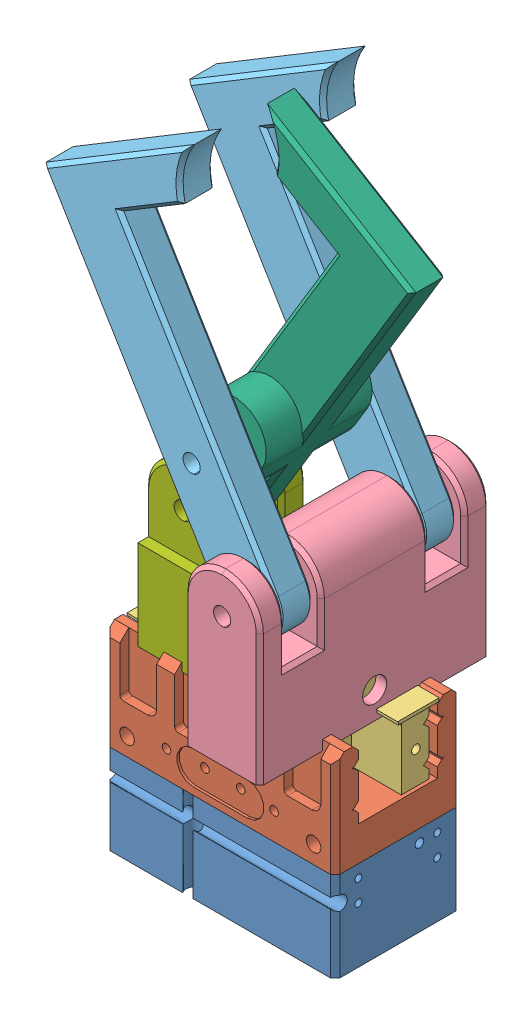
SolidWorks assembly scissor_draft3_assembly.SLDASM, configuration Default (file format 15000). Lengths in mm.
Overall size (107.7 189.3 64).
9 component instances, 7 part files, 23 mates.
Components (placement in the parent):
- SCHUNK-5518814 Gehaeuse MPG-plus 64-1: SCHUNK-5518814 Gehaeuse MPG-plus 64.sldprt [Default] at (0 25 0) x (1 0 0) z (0 0 -1) size (64.01 25 35.01)
- SCHUNK-5518813 Abdeckgehaeuse MPG-plus 64-1: SCHUNK-5518813 Abdeckgehaeuse MPG-plus 64.sldprt [Default] at (0 25 0) x (0 0 1) z (-1 0 0) size (35 29 64)
- SCHUNK-5518813 Finger MPG-plus 64-1: SCHUNK-5518813 Finger MPG-plus 64.sldprt [Default] at (-22 69.7 -0.75) x (-1 0 0) z (0 0 1) size (54 35.1 21.5)
- SCHUNK-5518813 Finger MPG-plus 64-2: SCHUNK-5518813 Finger MPG-plus 64.sldprt [Default] at (22 69.7 0.75) x (1 0 0) z (0 0 -1) size (54 35.1 21.5)
- scissor_attachment2_draft1-1: scissor_attachment2_draft1.SLDPRT [Default] at (5 76.2 0.5) x (-1 0 0) z (0 0 1) size (21 47 64)
- scissor1prong_draft1-2: scissor1prong_draft1.SLDPRT [Default] at (9.0491 61.1158 -19.25) x (-0.516667 0.856187 0) z (0 0 -1) size (104.5 48.36 9.5)
- scissor1prong_draft1-3: scissor1prong_draft1.SLDPRT [Default] at (9.0491 61.1158 20.75) x (-0.516667 0.856187 0) z (0 0 -1) size (104.5 48.36 9.5)
- scissor_middle_prong_draft1-1: scissor_middle_prong_draft1.SLDPRT [Default] at (-9.0491 61.1158 0.75) x (0.516667 0.856187 0) z (0 0 1) size (104.5 48.36 29.5)
- scissor_attachment_draft3-1: scissor_attachment_draft3.SLDPRT [Default] at (-5 76.2 0.5) x (1 0 0) z (0 0 -1) size (21 47 30)
Mates (geometry in assembly coordinates):
- Coincident2: coincident anti-aligned: plane of SCHUNK-5518814 Gehaeuse MPG-plus 64-1 through (-32 25 17.5) normal (0 1 0); plane of SCHUNK-5518813 Abdeckgehaeuse MPG-plus 64-1 through (32 25 -17.5) normal (0 -1 0)
- Coincident3: coincident aligned: plane of SCHUNK-5518814 Gehaeuse MPG-plus 64-1 through (-32 25 -16.2) normal (-1 0 0); plane of SCHUNK-5518813 Abdeckgehaeuse MPG-plus 64-1 through (-32 25 16.2) normal (-1 0 0)
- Coincident4: coincident aligned: plane of SCHUNK-5518814 Gehaeuse MPG-plus 64-1 through (30.7 25 -17.5) normal (0 0 -1); plane of SCHUNK-5518813 Abdeckgehaeuse MPG-plus 64-1 through (-30.7 25 -17.5) normal (0 0 -1)
- Distance4: distance = 1.4 mm anti-aligned: plane of SCHUNK-5518813 Abdeckgehaeuse MPG-plus 64-1 through (-32 40.17 -11) normal (0 0 1); plane of SCHUNK-5518813 Finger MPG-plus 64-1 through (31 47.13 -9.6) normal (0 0 -1)
- Distance5: distance = 3.9 mm anti-aligned: plane of SCHUNK-5518813 Finger MPG-plus 64-1 through (-21 51.4 -1.95) normal (0 0 1); plane of SCHUNK-5518813 Finger MPG-plus 64-2 through (21 51.4 1.95) normal (0 0 -1)
- Coincident10: coincident anti-aligned: plane of SCHUNK-5518813 Abdeckgehaeuse MPG-plus 64-1 through (32 34.6 -11) normal (0 1 0); plane of SCHUNK-5518813 Finger MPG-plus 64-1 through (31 34.6 -1.95) normal (0 -1 0)
- LimitDistance2: limit distance = 10 mm aligned: plane of SCHUNK-5518813 Finger MPG-plus 64-1 through (-22 69.7 -11.5) normal (-1 0 0); plane of SCHUNK-5518813 Abdeckgehaeuse MPG-plus 64-1 through (-32 25 16.2) normal (-1 0 0)
- LimitDistance3: limit distance = 10 mm aligned: plane of SCHUNK-5518813 Finger MPG-plus 64-2 through (22 69.7 11.5) normal (1 0 0); plane of SCHUNK-5518813 Abdeckgehaeuse MPG-plus 64-1 through (32 25 16.2) normal (1 0 0)
- Coincident15: coincident anti-aligned: plane of SCHUNK-5518813 Abdeckgehaeuse MPG-plus 64-1 through (32 34.6 -11) normal (0 1 0); plane of SCHUNK-5518813 Finger MPG-plus 64-2 through (-31 34.6 1.95) normal (0 -1 0)
- Coincident19: coincident anti-aligned: plane of SCHUNK-5518813 Finger MPG-plus 64-2 through (12 69.7 10) normal (0 1 0); plane of scissor_attachment2_draft1-1 through (5 69.7 0.5) normal (0 -1 0)
- Coincident20: coincident anti-aligned: plane of SCHUNK-5518813 Finger MPG-plus 64-2 through (12 69.7 -10) normal (0 0 -1); plane of scissor_attachment2_draft1-1 through (23 69.7 -10) normal (0 0 1)
- Coincident21: coincident anti-aligned: plane of SCHUNK-5518813 Finger MPG-plus 64-2 through (12 69.7 -10) normal (-1 0 0); plane of scissor_attachment2_draft1-1 through (12 69.7 -10) normal (1 0 0)
- Concentric2: concentric aligned: cylinder of scissor_attachment2_draft1-1 through (15.5 87.2 -31.5) axis (0 0 1) radius 2.4; cylinder of scissor1prong_draft1-3 through (15.5 87.2 16) axis (0 0 1) radius 2.4
- Coincident23: coincident anti-aligned: plane of scissor_attachment2_draft1-1 through (26 98.2 25.5) normal (0 0 -1); plane of scissor1prong_draft1-3 through (16.6227 178.3952 25.5) normal (0 0 1)
- Concentric3: concentric aligned: cylinder of scissor_attachment2_draft1-1 through (15.5 87.2 -31.5) axis (0 0 1) radius 2.4; cylinder of scissor1prong_draft1-2 through (15.5 87.2 -24) axis (0 0 1) radius 2.4
- Coincident25: coincident aligned: plane of scissor1prong_draft1-2 through (27.8557 84.1443 -24) normal (0.856187 0.516667 0); plane of scissor1prong_draft1-3 through (27.8557 84.1443 16) normal (0.856187 0.516667 0)
- Coincident26: coincident anti-aligned: plane of scissor_attachment2_draft1-1 through (26 98.2 -14.5) normal (0 0 -1); plane of scissor1prong_draft1-2 through (16.6227 178.3952 -14.5) normal (0 0 1)
- Coincident27: coincident anti-aligned: plane of SCHUNK-5518813 Finger MPG-plus 64-1 through (-12 69.7 -10) normal (0 1 0); plane of scissor_attachment_draft3-1 through (-5 69.7 0.5) normal (0 -1 0)
- Coincident28: coincident anti-aligned: plane of SCHUNK-5518813 Finger MPG-plus 64-1 through (-12 69.7 -10) normal (0 0 -1); plane of scissor_attachment_draft3-1 through (-23 69.7 -10) normal (0 0 1)
- Coincident29: coincident anti-aligned: plane of SCHUNK-5518813 Finger MPG-plus 64-1 through (-12 69.7 10) normal (1 0 0); plane of scissor_attachment_draft3-1 through (-12 69.7 11) normal (-1 0 0)
- Concentric4: concentric aligned: cylinder of scissor_middle_prong_draft1-1 through (-15.5 87.2 5.5) axis (0 0 -1) radius 2.4; cylinder of scissor_attachment_draft3-1 through (-15.5 87.2 15.5) axis (0 0 -1) radius 2.4
- Coincident30: coincident anti-aligned: plane of scissor_middle_prong_draft1-1 through (-16.6227 178.3952 5.5) normal (0 0 1); plane of scissor_attachment_draft3-1 through (-26 98.2 5.5) normal (0 0 -1)
- Concentric6: concentric anti-aligned: cylinder of scissor1prong_draft1-3 through (0 112.8856 16) axis (0 0 1) radius 2.4; cylinder of scissor_middle_prong_draft1-1 through (0 112.8856 5.5) axis (0 0 -1) radius 2.4
